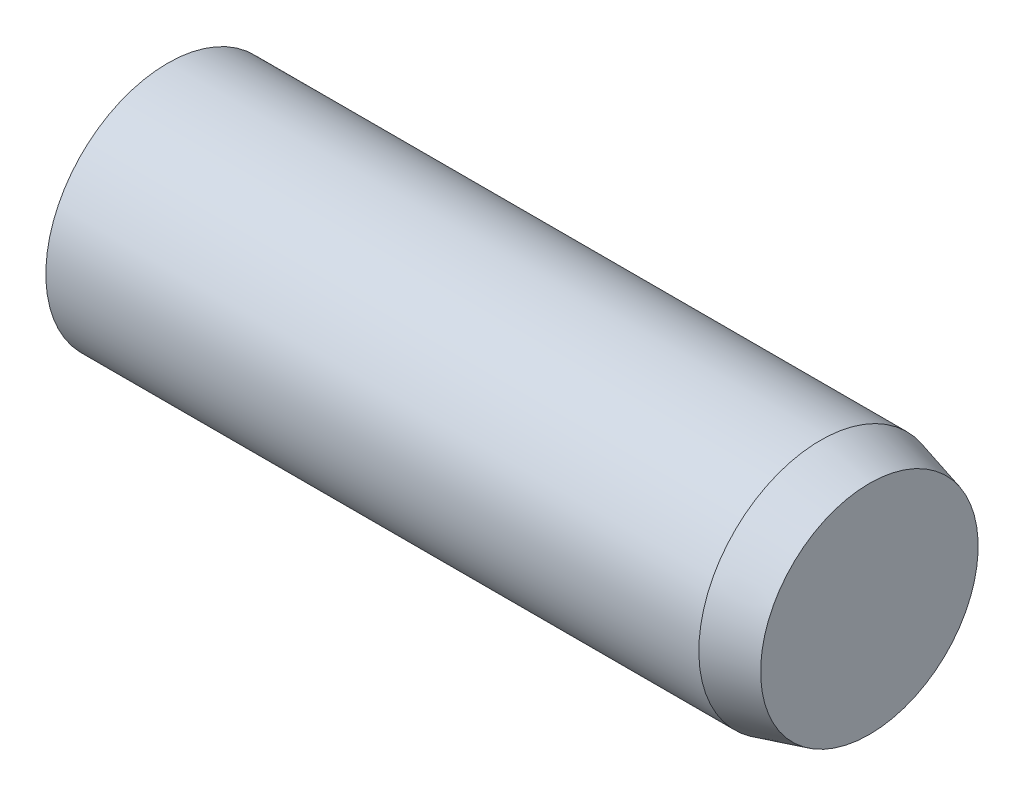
from build123d import *


with BuildPart() as part:
    # BodySke → Body (revolve)
    with BuildSketch(Plane.XY, mode=Mode.PRIVATE) as body_sk:
        with BuildLine():
            Line((28, 5), (30, 4.464101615))
            Line((30, 4.464101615), (30, 0))
            Line((30, 0), (0, 0))
            ThreePointArc((0, 0), (0.30419989, 2.570992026), (1.2, 5))
            Line((1.2, 5), (28, 5))
        make_face()
    revolve(body_sk.sketch.rotate(Axis((0, 0, 0), (1, 0, 0)), 180), axis=Axis((0, 0, 0), (1, 0, 0)))


solid = part.part
